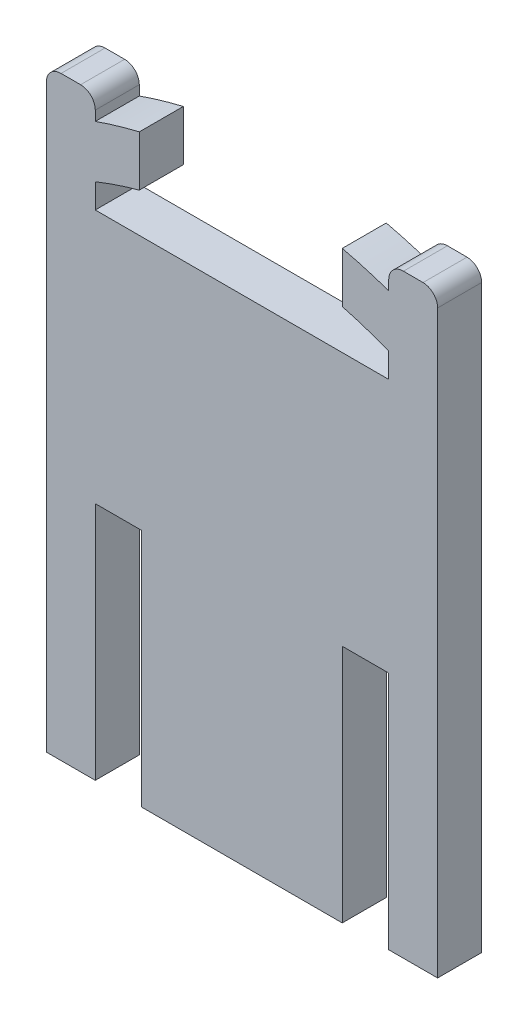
ISO-10303-21;
HEADER;
FILE_DESCRIPTION(('STEP AP214'),'2;1');
FILE_NAME('part.step','',(''),(''),'','','');
FILE_SCHEMA(('AUTOMOTIVE_DESIGN { 1 0 10303 214 1 1 1 1 }'));
ENDSEC;
DATA;
#1=APPLICATION_CONTEXT('core data for automotive mechanical design processes');
#2=APPLICATION_PROTOCOL_DEFINITION('international standard','automotive_design',2000,#1);
#3=PRODUCT_CONTEXT('',#1,'mechanical');
#4=PRODUCT('Part','Part','',(#3));
#5=PRODUCT_RELATED_PRODUCT_CATEGORY('part','',(#4));
#6=PRODUCT_DEFINITION_FORMATION('','',#4);
#7=PRODUCT_DEFINITION_CONTEXT('part definition',#1,'design');
#8=PRODUCT_DEFINITION('design','',#6,#7);
#9=PRODUCT_DEFINITION_SHAPE('','',#8);
#10=(LENGTH_UNIT() NAMED_UNIT(*) SI_UNIT(.MILLI.,.METRE.));
#11=(NAMED_UNIT(*) PLANE_ANGLE_UNIT() SI_UNIT($,.RADIAN.));
#12=(NAMED_UNIT(*) SI_UNIT($,.STERADIAN.) SOLID_ANGLE_UNIT());
#13=UNCERTAINTY_MEASURE_WITH_UNIT(LENGTH_MEASURE(1.E-05),#10,'distance_accuracy_value','');
#14=(GEOMETRIC_REPRESENTATION_CONTEXT(3) GLOBAL_UNCERTAINTY_ASSIGNED_CONTEXT((#13)) GLOBAL_UNIT_ASSIGNED_CONTEXT((#10,
#11,#12)) REPRESENTATION_CONTEXT('',''));
#15=CARTESIAN_POINT('',(0.,0.,0.));
#16=DIRECTION('',(0.,0.,1.));
#17=DIRECTION('',(1.,0.,0.));
#18=AXIS2_PLACEMENT_3D('',#15,#16,#17);
#19=CARTESIAN_POINT('',(-37.,127.683222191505,9.));
#20=DIRECTION('',(0.,0.,-1.));
#21=DIRECTION('',(-1.,0.,0.));
#22=AXIS2_PLACEMENT_3D('',#19,#20,#21);
#23=CYLINDRICAL_SURFACE('',#22,3.);
#24=CARTESIAN_POINT('',(-37.,127.683222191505,0.));
#25=DIRECTION('',(0.,0.,1.));
#26=DIRECTION('',(1.,0.,0.));
#27=AXIS2_PLACEMENT_3D('',#24,#25,#26);
#28=CIRCLE('',#27,3.);
#29=CARTESIAN_POINT('',(-40.,127.683222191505,0.));
#30=VERTEX_POINT('',#29);
#31=CARTESIAN_POINT('',(-37.,130.683222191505,0.));
#32=VERTEX_POINT('',#31);
#33=EDGE_CURVE('E247',#30,#32,#28,.F.);
#34=ORIENTED_EDGE('',*,*,#33,.F.);
#35=DIRECTION('',(0.,0.,-1.));
#36=VECTOR('',#35,1.);
#37=CARTESIAN_POINT('',(-40.,127.683222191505,9.));
#38=LINE('',#37,#36);
#39=CARTESIAN_POINT('',(-40.,127.683222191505,9.));
#40=VERTEX_POINT('',#39);
#41=EDGE_CURVE('E11',#40,#30,#38,.T.);
#42=ORIENTED_EDGE('',*,*,#41,.F.);
#43=CARTESIAN_POINT('',(-37.,127.683222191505,9.));
#44=DIRECTION('',(0.,0.,1.));
#45=DIRECTION('',(1.,0.,0.));
#46=AXIS2_PLACEMENT_3D('',#43,#44,#45);
#47=CIRCLE('',#46,3.);
#48=CARTESIAN_POINT('',(-37.,130.683222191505,9.));
#49=VERTEX_POINT('',#48);
#50=EDGE_CURVE('E321',#40,#49,#47,.F.);
#51=ORIENTED_EDGE('',*,*,#50,.T.);
#52=DIRECTION('',(0.,0.,-1.));
#53=VECTOR('',#52,1.);
#54=CARTESIAN_POINT('',(-37.,130.683222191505,9.));
#55=LINE('',#54,#53);
#56=EDGE_CURVE('E51',#49,#32,#55,.T.);
#57=ORIENTED_EDGE('',*,*,#56,.T.);
#58=EDGE_LOOP('',(#34,#42,#51,#57));
#59=FACE_BOUND('',#58,.T.);
#60=ADVANCED_FACE('F35',(#59),#23,.T.);
#61=CARTESIAN_POINT('',(-40.,-43.5699209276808,9.));
#62=DIRECTION('',(-1.,0.,0.));
#63=DIRECTION('',(0.,0.,1.));
#64=AXIS2_PLACEMENT_3D('',#61,#62,#63);
#65=PLANE('',#64);
#66=DIRECTION('',(0.,1.,0.));
#67=VECTOR('',#66,1.);
#68=CARTESIAN_POINT('',(-40.,-43.5699209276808,0.));
#69=LINE('',#68,#67);
#70=CARTESIAN_POINT('',(-40.,8.99999999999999,0.));
#71=VERTEX_POINT('',#70);
#72=EDGE_CURVE('E249',#71,#30,#69,.T.);
#73=ORIENTED_EDGE('',*,*,#72,.F.);
#74=DIRECTION('',(0.,0.,-1.));
#75=VECTOR('',#74,1.);
#76=CARTESIAN_POINT('',(-40.,8.99999999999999,9.));
#77=LINE('',#76,#75);
#78=CARTESIAN_POINT('',(-40.,8.99999999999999,9.));
#79=VERTEX_POINT('',#78);
#80=EDGE_CURVE('E43',#79,#71,#77,.T.);
#81=ORIENTED_EDGE('',*,*,#80,.F.);
#82=DIRECTION('',(0.,1.,0.));
#83=VECTOR('',#82,1.);
#84=CARTESIAN_POINT('',(-40.,-43.5699209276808,9.));
#85=LINE('',#84,#83);
#86=EDGE_CURVE('E778',#79,#40,#85,.T.);
#87=ORIENTED_EDGE('',*,*,#86,.T.);
#88=ORIENTED_EDGE('',*,*,#41,.T.);
#89=EDGE_LOOP('',(#73,#81,#87,#88));
#90=FACE_BOUND('',#89,.T.);
#91=ADVANCED_FACE('F384',(#90),#65,.T.);
#92=CARTESIAN_POINT('',(0.,8.99999999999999,9.));
#93=DIRECTION('',(0.,-1.,0.));
#94=DIRECTION('',(0.,0.,-1.));
#95=AXIS2_PLACEMENT_3D('',#92,#93,#94);
#96=PLANE('',#95);
#97=DIRECTION('',(-1.,0.,0.));
#98=VECTOR('',#97,1.);
#99=CARTESIAN_POINT('',(0.,8.99999999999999,0.));
#100=LINE('',#99,#98);
#101=CARTESIAN_POINT('',(-30.,9.,0.));
#102=VERTEX_POINT('',#101);
#103=EDGE_CURVE('E252',#102,#71,#100,.T.);
#104=ORIENTED_EDGE('',*,*,#103,.F.);
#105=DIRECTION('',(0.,0.,-1.));
#106=VECTOR('',#105,1.);
#107=CARTESIAN_POINT('',(-30.,9.,9.));
#108=LINE('',#107,#106);
#109=CARTESIAN_POINT('',(-30.,9.,9.));
#110=VERTEX_POINT('',#109);
#111=EDGE_CURVE('E373',#110,#102,#108,.T.);
#112=ORIENTED_EDGE('',*,*,#111,.F.);
#113=DIRECTION('',(-1.,0.,0.));
#114=VECTOR('',#113,1.);
#115=CARTESIAN_POINT('',(0.,8.99999999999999,9.));
#116=LINE('',#115,#114);
#117=EDGE_CURVE('E380',#110,#79,#116,.T.);
#118=ORIENTED_EDGE('',*,*,#117,.T.);
#119=ORIENTED_EDGE('',*,*,#80,.T.);
#120=EDGE_LOOP('',(#104,#112,#118,#119));
#121=FACE_BOUND('',#120,.T.);
#122=ADVANCED_FACE('F378',(#121),#96,.T.);
#123=CARTESIAN_POINT('',(-30.,-43.5699209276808,9.));
#124=DIRECTION('',(-1.,0.,0.));
#125=DIRECTION('',(0.,-1.,0.));
#126=AXIS2_PLACEMENT_3D('',#123,#124,#125);
#127=PLANE('',#126);
#128=DIRECTION('',(0.,1.,0.));
#129=VECTOR('',#128,1.);
#130=CARTESIAN_POINT('',(-30.,-43.5699209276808,0.));
#131=LINE('',#130,#129);
#132=CARTESIAN_POINT('',(-30.,58.,0.));
#133=VERTEX_POINT('',#132);
#134=EDGE_CURVE('E255',#102,#133,#131,.T.);
#135=ORIENTED_EDGE('',*,*,#134,.T.);
#136=DIRECTION('',(0.,0.,-1.));
#137=VECTOR('',#136,1.);
#138=CARTESIAN_POINT('',(-30.,58.,9.));
#139=LINE('',#138,#137);
#140=CARTESIAN_POINT('',(-30.,58.,9.));
#141=VERTEX_POINT('',#140);
#142=EDGE_CURVE('E370',#141,#133,#139,.T.);
#143=ORIENTED_EDGE('',*,*,#142,.F.);
#144=DIRECTION('',(0.,1.,0.));
#145=VECTOR('',#144,1.);
#146=CARTESIAN_POINT('',(-30.,-43.5699209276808,9.));
#147=LINE('',#146,#145);
#148=EDGE_CURVE('E401',#110,#141,#147,.T.);
#149=ORIENTED_EDGE('',*,*,#148,.F.);
#150=ORIENTED_EDGE('',*,*,#111,.T.);
#151=EDGE_LOOP('',(#135,#143,#149,#150));
#152=FACE_BOUND('',#151,.T.);
#153=ADVANCED_FACE('F392',(#152),#127,.F.);
#154=CARTESIAN_POINT('',(0.,58.,9.));
#155=DIRECTION('',(0.,1.,0.));
#156=DIRECTION('',(0.,0.,1.));
#157=AXIS2_PLACEMENT_3D('',#154,#155,#156);
#158=PLANE('',#157);
#159=DIRECTION('',(1.,0.,0.));
#160=VECTOR('',#159,1.);
#161=CARTESIAN_POINT('',(0.,58.,0.));
#162=LINE('',#161,#160);
#163=CARTESIAN_POINT('',(-20.5,58.,0.));
#164=VERTEX_POINT('',#163);
#165=EDGE_CURVE('E257',#133,#164,#162,.T.);
#166=ORIENTED_EDGE('',*,*,#165,.T.);
#167=DIRECTION('',(0.,0.,-1.));
#168=VECTOR('',#167,1.);
#169=CARTESIAN_POINT('',(-20.5,58.,9.));
#170=LINE('',#169,#168);
#171=CARTESIAN_POINT('',(-20.5,58.,9.));
#172=VERTEX_POINT('',#171);
#173=EDGE_CURVE('E367',#172,#164,#170,.T.);
#174=ORIENTED_EDGE('',*,*,#173,.F.);
#175=DIRECTION('',(1.,0.,0.));
#176=VECTOR('',#175,1.);
#177=CARTESIAN_POINT('',(0.,58.,9.));
#178=LINE('',#177,#176);
#179=EDGE_CURVE('E398',#141,#172,#178,.T.);
#180=ORIENTED_EDGE('',*,*,#179,.F.);
#181=ORIENTED_EDGE('',*,*,#142,.T.);
#182=EDGE_LOOP('',(#166,#174,#180,#181));
#183=FACE_BOUND('',#182,.T.);
#184=ADVANCED_FACE('F396',(#183),#158,.F.);
#185=CARTESIAN_POINT('',(-20.5,-43.5699209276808,9.));
#186=DIRECTION('',(1.,0.,0.));
#187=DIRECTION('',(0.,1.,0.));
#188=AXIS2_PLACEMENT_3D('',#185,#186,#187);
#189=PLANE('',#188);
#190=DIRECTION('',(0.,-1.,0.));
#191=VECTOR('',#190,1.);
#192=CARTESIAN_POINT('',(-20.5,-43.5699209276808,0.));
#193=LINE('',#192,#191);
#194=CARTESIAN_POINT('',(-20.5,8.99999999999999,0.));
#195=VERTEX_POINT('',#194);
#196=EDGE_CURVE('E259',#164,#195,#193,.T.);
#197=ORIENTED_EDGE('',*,*,#196,.T.);
#198=DIRECTION('',(0.,0.,-1.));
#199=VECTOR('',#198,1.);
#200=CARTESIAN_POINT('',(-20.5,8.99999999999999,9.));
#201=LINE('',#200,#199);
#202=CARTESIAN_POINT('',(-20.5,8.99999999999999,9.));
#203=VERTEX_POINT('',#202);
#204=EDGE_CURVE('E365',#203,#195,#201,.T.);
#205=ORIENTED_EDGE('',*,*,#204,.F.);
#206=DIRECTION('',(0.,-1.,0.));
#207=VECTOR('',#206,1.);
#208=CARTESIAN_POINT('',(-20.5,-43.5699209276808,9.));
#209=LINE('',#208,#207);
#210=EDGE_CURVE('E400',#172,#203,#209,.T.);
#211=ORIENTED_EDGE('',*,*,#210,.F.);
#212=ORIENTED_EDGE('',*,*,#173,.T.);
#213=EDGE_LOOP('',(#197,#205,#211,#212));
#214=FACE_BOUND('',#213,.T.);
#215=ADVANCED_FACE('F485',(#214),#189,.F.);
#216=CARTESIAN_POINT('',(0.,9.,9.));
#217=DIRECTION('',(0.,-1.,0.));
#218=DIRECTION('',(1.,0.,0.));
#219=AXIS2_PLACEMENT_3D('',#216,#217,#218);
#220=PLANE('',#219);
#221=DIRECTION('',(-1.,0.,0.));
#222=VECTOR('',#221,1.);
#223=CARTESIAN_POINT('',(0.,9.,0.));
#224=LINE('',#223,#222);
#225=CARTESIAN_POINT('',(20.5,9.,0.));
#226=VERTEX_POINT('',#225);
#227=EDGE_CURVE('E262',#226,#195,#224,.T.);
#228=ORIENTED_EDGE('',*,*,#227,.F.);
#229=DIRECTION('',(0.,0.,-1.));
#230=VECTOR('',#229,1.);
#231=CARTESIAN_POINT('',(20.5,9.,9.));
#232=LINE('',#231,#230);
#233=CARTESIAN_POINT('',(20.5,9.,9.));
#234=VERTEX_POINT('',#233);
#235=EDGE_CURVE('E363',#234,#226,#232,.T.);
#236=ORIENTED_EDGE('',*,*,#235,.F.);
#237=DIRECTION('',(-1.,0.,0.));
#238=VECTOR('',#237,1.);
#239=CARTESIAN_POINT('',(0.,9.,9.));
#240=LINE('',#239,#238);
#241=EDGE_CURVE('E403',#234,#203,#240,.T.);
#242=ORIENTED_EDGE('',*,*,#241,.T.);
#243=ORIENTED_EDGE('',*,*,#204,.T.);
#244=EDGE_LOOP('',(#228,#236,#242,#243));
#245=FACE_BOUND('',#244,.T.);
#246=ADVANCED_FACE('F488',(#245),#220,.T.);
#247=CARTESIAN_POINT('',(20.5,-43.5699209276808,9.));
#248=DIRECTION('',(1.,0.,0.));
#249=DIRECTION('',(0.,1.,0.));
#250=AXIS2_PLACEMENT_3D('',#247,#248,#249);
#251=PLANE('',#250);
#252=DIRECTION('',(0.,-1.,0.));
#253=VECTOR('',#252,1.);
#254=CARTESIAN_POINT('',(20.5,-43.5699209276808,0.));
#255=LINE('',#254,#253);
#256=CARTESIAN_POINT('',(20.5,58.,0.));
#257=VERTEX_POINT('',#256);
#258=EDGE_CURVE('E265',#257,#226,#255,.T.);
#259=ORIENTED_EDGE('',*,*,#258,.F.);
#260=DIRECTION('',(0.,0.,-1.));
#261=VECTOR('',#260,1.);
#262=CARTESIAN_POINT('',(20.5,58.,9.));
#263=LINE('',#262,#261);
#264=CARTESIAN_POINT('',(20.5,58.,9.));
#265=VERTEX_POINT('',#264);
#266=EDGE_CURVE('E361',#265,#257,#263,.T.);
#267=ORIENTED_EDGE('',*,*,#266,.F.);
#268=DIRECTION('',(0.,-1.,0.));
#269=VECTOR('',#268,1.);
#270=CARTESIAN_POINT('',(20.5,-43.5699209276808,9.));
#271=LINE('',#270,#269);
#272=EDGE_CURVE('E410',#265,#234,#271,.T.);
#273=ORIENTED_EDGE('',*,*,#272,.T.);
#274=ORIENTED_EDGE('',*,*,#235,.T.);
#275=EDGE_LOOP('',(#259,#267,#273,#274));
#276=FACE_BOUND('',#275,.T.);
#277=ADVANCED_FACE('F492',(#276),#251,.T.);
#278=CARTESIAN_POINT('',(0.,58.,9.));
#279=DIRECTION('',(0.,-1.,0.));
#280=DIRECTION('',(1.,0.,0.));
#281=AXIS2_PLACEMENT_3D('',#278,#279,#280);
#282=PLANE('',#281);
#283=DIRECTION('',(-1.,0.,0.));
#284=VECTOR('',#283,1.);
#285=CARTESIAN_POINT('',(0.,58.,0.));
#286=LINE('',#285,#284);
#287=CARTESIAN_POINT('',(30.,58.,0.));
#288=VERTEX_POINT('',#287);
#289=EDGE_CURVE('E268',#288,#257,#286,.T.);
#290=ORIENTED_EDGE('',*,*,#289,.F.);
#291=DIRECTION('',(0.,0.,-1.));
#292=VECTOR('',#291,1.);
#293=CARTESIAN_POINT('',(30.,58.,9.));
#294=LINE('',#293,#292);
#295=CARTESIAN_POINT('',(30.,58.,9.));
#296=VERTEX_POINT('',#295);
#297=EDGE_CURVE('E359',#296,#288,#294,.T.);
#298=ORIENTED_EDGE('',*,*,#297,.F.);
#299=DIRECTION('',(-1.,0.,0.));
#300=VECTOR('',#299,1.);
#301=CARTESIAN_POINT('',(0.,58.,9.));
#302=LINE('',#301,#300);
#303=EDGE_CURVE('E413',#296,#265,#302,.T.);
#304=ORIENTED_EDGE('',*,*,#303,.T.);
#305=ORIENTED_EDGE('',*,*,#266,.T.);
#306=EDGE_LOOP('',(#290,#298,#304,#305));
#307=FACE_BOUND('',#306,.T.);
#308=ADVANCED_FACE('F496',(#307),#282,.T.);
#309=CARTESIAN_POINT('',(30.,-43.5699209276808,9.));
#310=DIRECTION('',(-1.,0.,0.));
#311=DIRECTION('',(0.,-1.,0.));
#312=AXIS2_PLACEMENT_3D('',#309,#310,#311);
#313=PLANE('',#312);
#314=DIRECTION('',(0.,1.,0.));
#315=VECTOR('',#314,1.);
#316=CARTESIAN_POINT('',(30.,-43.5699209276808,0.));
#317=LINE('',#316,#315);
#318=CARTESIAN_POINT('',(30.,9.00000000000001,0.));
#319=VERTEX_POINT('',#318);
#320=EDGE_CURVE('E271',#319,#288,#317,.T.);
#321=ORIENTED_EDGE('',*,*,#320,.F.);
#322=DIRECTION('',(0.,0.,-1.));
#323=VECTOR('',#322,1.);
#324=CARTESIAN_POINT('',(30.,9.00000000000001,9.));
#325=LINE('',#324,#323);
#326=CARTESIAN_POINT('',(30.,9.00000000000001,9.));
#327=VERTEX_POINT('',#326);
#328=EDGE_CURVE('E357',#327,#319,#325,.T.);
#329=ORIENTED_EDGE('',*,*,#328,.F.);
#330=DIRECTION('',(0.,1.,0.));
#331=VECTOR('',#330,1.);
#332=CARTESIAN_POINT('',(30.,-43.5699209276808,9.));
#333=LINE('',#332,#331);
#334=EDGE_CURVE('E416',#327,#296,#333,.T.);
#335=ORIENTED_EDGE('',*,*,#334,.T.);
#336=ORIENTED_EDGE('',*,*,#297,.T.);
#337=EDGE_LOOP('',(#321,#329,#335,#336));
#338=FACE_BOUND('',#337,.T.);
#339=ADVANCED_FACE('F500',(#338),#313,.T.);
#340=CARTESIAN_POINT('',(0.,9.00000000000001,9.));
#341=DIRECTION('',(0.,1.,0.));
#342=DIRECTION('',(0.,0.,1.));
#343=AXIS2_PLACEMENT_3D('',#340,#341,#342);
#344=PLANE('',#343);
#345=DIRECTION('',(1.,0.,0.));
#346=VECTOR('',#345,1.);
#347=CARTESIAN_POINT('',(0.,9.00000000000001,0.));
#348=LINE('',#347,#346);
#349=CARTESIAN_POINT('',(40.,9.00000000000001,0.));
#350=VERTEX_POINT('',#349);
#351=EDGE_CURVE('E274',#319,#350,#348,.T.);
#352=ORIENTED_EDGE('',*,*,#351,.T.);
#353=DIRECTION('',(0.,0.,-1.));
#354=VECTOR('',#353,1.);
#355=CARTESIAN_POINT('',(40.,9.00000000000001,9.));
#356=LINE('',#355,#354);
#357=CARTESIAN_POINT('',(40.,9.00000000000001,9.));
#358=VERTEX_POINT('',#357);
#359=EDGE_CURVE('E354',#358,#350,#356,.T.);
#360=ORIENTED_EDGE('',*,*,#359,.F.);
#361=DIRECTION('',(1.,0.,0.));
#362=VECTOR('',#361,1.);
#363=CARTESIAN_POINT('',(0.,9.00000000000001,9.));
#364=LINE('',#363,#362);
#365=EDGE_CURVE('E419',#327,#358,#364,.T.);
#366=ORIENTED_EDGE('',*,*,#365,.F.);
#367=ORIENTED_EDGE('',*,*,#328,.T.);
#368=EDGE_LOOP('',(#352,#360,#366,#367));
#369=FACE_BOUND('',#368,.T.);
#370=ADVANCED_FACE('F504',(#369),#344,.F.);
#371=CARTESIAN_POINT('',(40.,-43.5699209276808,9.));
#372=DIRECTION('',(-1.,0.,0.));
#373=DIRECTION('',(0.,-1.,0.));
#374=AXIS2_PLACEMENT_3D('',#371,#372,#373);
#375=PLANE('',#374);
#376=DIRECTION('',(0.,1.,0.));
#377=VECTOR('',#376,1.);
#378=CARTESIAN_POINT('',(40.,-43.5699209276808,0.));
#379=LINE('',#378,#377);
#380=CARTESIAN_POINT('',(40.,127.654703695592,0.));
#381=VERTEX_POINT('',#380);
#382=EDGE_CURVE('E276',#350,#381,#379,.T.);
#383=ORIENTED_EDGE('',*,*,#382,.T.);
#384=DIRECTION('',(0.,0.,-1.));
#385=VECTOR('',#384,1.);
#386=CARTESIAN_POINT('',(40.,127.654703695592,9.));
#387=LINE('',#386,#385);
#388=CARTESIAN_POINT('',(40.,127.654703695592,9.));
#389=VERTEX_POINT('',#388);
#390=EDGE_CURVE('E352',#389,#381,#387,.T.);
#391=ORIENTED_EDGE('',*,*,#390,.F.);
#392=DIRECTION('',(0.,1.,0.));
#393=VECTOR('',#392,1.);
#394=CARTESIAN_POINT('',(40.,-43.5699209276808,9.));
#395=LINE('',#394,#393);
#396=EDGE_CURVE('E421',#358,#389,#395,.T.);
#397=ORIENTED_EDGE('',*,*,#396,.F.);
#398=ORIENTED_EDGE('',*,*,#359,.T.);
#399=EDGE_LOOP('',(#383,#391,#397,#398));
#400=FACE_BOUND('',#399,.T.);
#401=ADVANCED_FACE('F508',(#400),#375,.F.);
#402=CARTESIAN_POINT('',(37.,127.654703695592,9.));
#403=DIRECTION('',(0.,0.,-1.));
#404=DIRECTION('',(-1.,0.,0.));
#405=AXIS2_PLACEMENT_3D('',#402,#403,#404);
#406=CYLINDRICAL_SURFACE('',#405,3.);
#407=CARTESIAN_POINT('',(37.,127.654703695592,0.));
#408=DIRECTION('',(0.,0.,1.));
#409=DIRECTION('',(1.,0.,0.));
#410=AXIS2_PLACEMENT_3D('',#407,#408,#409);
#411=CIRCLE('',#410,3.);
#412=CARTESIAN_POINT('',(37.0122114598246,130.654678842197,0.));
#413=VERTEX_POINT('',#412);
#414=EDGE_CURVE('E279',#413,#381,#411,.F.);
#415=ORIENTED_EDGE('',*,*,#414,.F.);
#416=DIRECTION('',(0.,0.,-1.));
#417=VECTOR('',#416,1.);
#418=CARTESIAN_POINT('',(37.0122114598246,130.654678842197,9.));
#419=LINE('',#418,#417);
#420=CARTESIAN_POINT('',(37.0122114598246,130.654678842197,9.));
#421=VERTEX_POINT('',#420);
#422=EDGE_CURVE('E350',#421,#413,#419,.T.);
#423=ORIENTED_EDGE('',*,*,#422,.F.);
#424=CARTESIAN_POINT('',(37.,127.654703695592,9.));
#425=DIRECTION('',(0.,0.,1.));
#426=DIRECTION('',(1.,0.,0.));
#427=AXIS2_PLACEMENT_3D('',#424,#425,#426);
#428=CIRCLE('',#427,3.);
#429=EDGE_CURVE('E423',#421,#389,#428,.F.);
#430=ORIENTED_EDGE('',*,*,#429,.T.);
#431=ORIENTED_EDGE('',*,*,#390,.T.);
#432=EDGE_LOOP('',(#415,#423,#430,#431));
#433=FACE_BOUND('',#432,.T.);
#434=ADVANCED_FACE('F512',(#433),#406,.T.);
#435=CARTESIAN_POINT('',(0.70978627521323,130.80244860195,9.));
#436=DIRECTION('',(-0.00407048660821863,-0.99999171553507,0.));
#437=DIRECTION('',(0.99999171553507,-0.00407048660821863,0.));
#438=AXIS2_PLACEMENT_3D('',#435,#436,#437);
#439=PLANE('',#438);
#440=DIRECTION('',(-0.99999171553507,0.00407048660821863,0.));
#441=VECTOR('',#440,1.);
#442=CARTESIAN_POINT('',(0.70978627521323,130.80244860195,0.));
#443=LINE('',#442,#441);
#444=CARTESIAN_POINT('',(33.0122114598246,130.670960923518,0.));
#445=VERTEX_POINT('',#444);
#446=EDGE_CURVE('E282',#413,#445,#443,.T.);
#447=ORIENTED_EDGE('',*,*,#446,.T.);
#448=DIRECTION('',(0.,0.,-1.));
#449=VECTOR('',#448,1.);
#450=CARTESIAN_POINT('',(33.0122114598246,130.670960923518,9.));
#451=LINE('',#450,#449);
#452=CARTESIAN_POINT('',(33.0122114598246,130.670960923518,9.));
#453=VERTEX_POINT('',#452);
#454=EDGE_CURVE('E348',#453,#445,#451,.T.);
#455=ORIENTED_EDGE('',*,*,#454,.F.);
#456=DIRECTION('',(-0.99999171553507,0.00407048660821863,0.));
#457=VECTOR('',#456,1.);
#458=CARTESIAN_POINT('',(0.70978627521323,130.80244860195,9.));
#459=LINE('',#458,#457);
#460=EDGE_CURVE('E426',#421,#453,#459,.T.);
#461=ORIENTED_EDGE('',*,*,#460,.F.);
#462=ORIENTED_EDGE('',*,*,#422,.T.);
#463=EDGE_LOOP('',(#447,#455,#461,#462));
#464=FACE_BOUND('',#463,.T.);
#465=ADVANCED_FACE('F516',(#464),#439,.F.);
#466=CARTESIAN_POINT('',(33.,127.670985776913,9.));
#467=DIRECTION('',(0.,0.,-1.));
#468=DIRECTION('',(-1.,0.,0.));
#469=AXIS2_PLACEMENT_3D('',#466,#467,#468);
#470=CYLINDRICAL_SURFACE('',#469,3.00000000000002);
#471=CARTESIAN_POINT('',(33.,127.670985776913,0.));
#472=DIRECTION('',(0.,0.,1.));
#473=DIRECTION('',(1.,0.,0.));
#474=AXIS2_PLACEMENT_3D('',#471,#472,#473);
#475=CIRCLE('',#474,3.00000000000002);
#476=CARTESIAN_POINT('',(30.,127.670985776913,0.));
#477=VERTEX_POINT('',#476);
#478=EDGE_CURVE('E285',#477,#445,#475,.F.);
#479=ORIENTED_EDGE('',*,*,#478,.F.);
#480=DIRECTION('',(0.,0.,-1.));
#481=VECTOR('',#480,1.);
#482=CARTESIAN_POINT('',(30.,127.670985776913,9.));
#483=LINE('',#482,#481);
#484=CARTESIAN_POINT('',(30.,127.670985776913,9.));
#485=VERTEX_POINT('',#484);
#486=EDGE_CURVE('E346',#485,#477,#483,.T.);
#487=ORIENTED_EDGE('',*,*,#486,.F.);
#488=CARTESIAN_POINT('',(33.,127.670985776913,9.));
#489=DIRECTION('',(0.,0.,1.));
#490=DIRECTION('',(1.,0.,0.));
#491=AXIS2_PLACEMENT_3D('',#488,#489,#490);
#492=CIRCLE('',#491,3.00000000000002);
#493=EDGE_CURVE('E428',#485,#453,#492,.F.);
#494=ORIENTED_EDGE('',*,*,#493,.T.);
#495=ORIENTED_EDGE('',*,*,#454,.T.);
#496=EDGE_LOOP('',(#479,#487,#494,#495));
#497=FACE_BOUND('',#496,.T.);
#498=ADVANCED_FACE('F520',(#497),#470,.T.);
#499=CARTESIAN_POINT('',(30.0000000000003,-43.5699209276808,9.));
#500=DIRECTION('',(1.,0.,0.));
#501=DIRECTION('',(0.,1.,0.));
#502=AXIS2_PLACEMENT_3D('',#499,#500,#501);
#503=PLANE('',#502);
#504=DIRECTION('',(0.,-1.,0.));
#505=VECTOR('',#504,1.);
#506=CARTESIAN_POINT('',(30.0000000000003,-43.5699209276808,0.));
#507=LINE('',#506,#505);
#508=CARTESIAN_POINT('',(30.,125.683180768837,0.));
#509=VERTEX_POINT('',#508);
#510=EDGE_CURVE('E288',#477,#509,#507,.T.);
#511=ORIENTED_EDGE('',*,*,#510,.T.);
#512=DIRECTION('',(0.,0.,-1.));
#513=VECTOR('',#512,1.);
#514=CARTESIAN_POINT('',(30.,125.683180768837,9.));
#515=LINE('',#514,#513);
#516=CARTESIAN_POINT('',(30.,125.683180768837,9.));
#517=VERTEX_POINT('',#516);
#518=EDGE_CURVE('E343',#517,#509,#515,.T.);
#519=ORIENTED_EDGE('',*,*,#518,.F.);
#520=DIRECTION('',(0.,-1.,0.));
#521=VECTOR('',#520,1.);
#522=CARTESIAN_POINT('',(30.0000000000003,-43.5699209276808,9.));
#523=LINE('',#522,#521);
#524=EDGE_CURVE('E431',#485,#517,#523,.T.);
#525=ORIENTED_EDGE('',*,*,#524,.F.);
#526=ORIENTED_EDGE('',*,*,#486,.T.);
#527=EDGE_LOOP('',(#511,#519,#525,#526));
#528=FACE_BOUND('',#527,.T.);
#529=ADVANCED_FACE('F524',(#528),#503,.F.);
#530=CARTESIAN_POINT('',(0.,40.3774210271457,9.));
#531=DIRECTION('',(0.,0.,-1.));
#532=DIRECTION('',(-1.,0.,0.));
#533=AXIS2_PLACEMENT_3D('',#530,#531,#532);
#534=CYLINDRICAL_SURFACE('',#533,90.4271676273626);
#535=CARTESIAN_POINT('',(0.,40.3774210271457,0.));
#536=DIRECTION('',(0.,0.,1.));
#537=DIRECTION('',(1.,0.,0.));
#538=AXIS2_PLACEMENT_3D('',#535,#536,#537);
#539=CIRCLE('',#538,90.4271676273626);
#540=CARTESIAN_POINT('',(20.5,128.450246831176,0.));
#541=VERTEX_POINT('',#540);
#542=EDGE_CURVE('E290',#509,#541,#539,.T.);
#543=ORIENTED_EDGE('',*,*,#542,.T.);
#544=DIRECTION('',(0.,0.,-1.));
#545=VECTOR('',#544,1.);
#546=CARTESIAN_POINT('',(20.5,128.450246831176,9.));
#547=LINE('',#546,#545);
#548=CARTESIAN_POINT('',(20.5,128.450246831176,9.));
#549=VERTEX_POINT('',#548);
#550=EDGE_CURVE('E340',#549,#541,#547,.T.);
#551=ORIENTED_EDGE('',*,*,#550,.F.);
#552=CARTESIAN_POINT('',(0.,40.3774210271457,9.));
#553=DIRECTION('',(0.,0.,1.));
#554=DIRECTION('',(1.,0.,0.));
#555=AXIS2_PLACEMENT_3D('',#552,#553,#554);
#556=CIRCLE('',#555,90.4271676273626);
#557=EDGE_CURVE('E433',#517,#549,#556,.T.);
#558=ORIENTED_EDGE('',*,*,#557,.F.);
#559=ORIENTED_EDGE('',*,*,#518,.T.);
#560=EDGE_LOOP('',(#543,#551,#558,#559));
#561=FACE_BOUND('',#560,.T.);
#562=ADVANCED_FACE('F528',(#561),#534,.T.);
#563=CARTESIAN_POINT('',(20.5,-43.5699209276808,9.));
#564=DIRECTION('',(1.,0.,0.));
#565=DIRECTION('',(0.,0.,-1.));
#566=AXIS2_PLACEMENT_3D('',#563,#564,#565);
#567=PLANE('',#566);
#568=DIRECTION('',(0.,-1.,0.));
#569=VECTOR('',#568,1.);
#570=CARTESIAN_POINT('',(20.5,-43.5699209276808,0.));
#571=LINE('',#570,#569);
#572=CARTESIAN_POINT('',(20.5,118.14810504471,0.));
#573=VERTEX_POINT('',#572);
#574=EDGE_CURVE('E292',#541,#573,#571,.T.);
#575=ORIENTED_EDGE('',*,*,#574,.T.);
#576=DIRECTION('',(0.,0.,-1.));
#577=VECTOR('',#576,1.);
#578=CARTESIAN_POINT('',(20.5,118.14810504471,9.));
#579=LINE('',#578,#577);
#580=CARTESIAN_POINT('',(20.5,118.14810504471,9.));
#581=VERTEX_POINT('',#580);
#582=EDGE_CURVE('E338',#581,#573,#579,.T.);
#583=ORIENTED_EDGE('',*,*,#582,.F.);
#584=DIRECTION('',(0.,-1.,0.));
#585=VECTOR('',#584,1.);
#586=CARTESIAN_POINT('',(20.5,-43.5699209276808,9.));
#587=LINE('',#586,#585);
#588=EDGE_CURVE('E435',#549,#581,#587,.T.);
#589=ORIENTED_EDGE('',*,*,#588,.F.);
#590=ORIENTED_EDGE('',*,*,#550,.T.);
#591=EDGE_LOOP('',(#575,#583,#589,#590));
#592=FACE_BOUND('',#591,.T.);
#593=ADVANCED_FACE('F532',(#592),#567,.F.);
#594=CARTESIAN_POINT('',(0.,40.3774210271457,9.));
#595=DIRECTION('',(0.,0.,-1.));
#596=DIRECTION('',(-1.,0.,0.));
#597=AXIS2_PLACEMENT_3D('',#594,#595,#596);
#598=CYLINDRICAL_SURFACE('',#597,80.4271676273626);
#599=CARTESIAN_POINT('',(0.,40.3774210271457,0.));
#600=DIRECTION('',(0.,0.,1.));
#601=DIRECTION('',(1.,0.,0.));
#602=AXIS2_PLACEMENT_3D('',#599,#600,#601);
#603=CIRCLE('',#602,80.4271676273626);
#604=CARTESIAN_POINT('',(30.,115.,0.));
#605=VERTEX_POINT('',#604);
#606=EDGE_CURVE('E295',#605,#573,#603,.T.);
#607=ORIENTED_EDGE('',*,*,#606,.F.);
#608=DIRECTION('',(0.,0.,-1.));
#609=VECTOR('',#608,1.);
#610=CARTESIAN_POINT('',(30.,115.,9.));
#611=LINE('',#610,#609);
#612=CARTESIAN_POINT('',(30.,115.,9.));
#613=VERTEX_POINT('',#612);
#614=EDGE_CURVE('E336',#613,#605,#611,.T.);
#615=ORIENTED_EDGE('',*,*,#614,.F.);
#616=CARTESIAN_POINT('',(0.,40.3774210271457,9.));
#617=DIRECTION('',(0.,0.,1.));
#618=DIRECTION('',(1.,0.,0.));
#619=AXIS2_PLACEMENT_3D('',#616,#617,#618);
#620=CIRCLE('',#619,80.4271676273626);
#621=EDGE_CURVE('E437',#613,#581,#620,.T.);
#622=ORIENTED_EDGE('',*,*,#621,.T.);
#623=ORIENTED_EDGE('',*,*,#582,.T.);
#624=EDGE_LOOP('',(#607,#615,#622,#623));
#625=FACE_BOUND('',#624,.T.);
#626=ADVANCED_FACE('F536',(#625),#598,.F.);
#627=CARTESIAN_POINT('',(29.9999999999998,-43.5699209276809,9.));
#628=DIRECTION('',(1.,0.,0.));
#629=DIRECTION('',(0.,1.,0.));
#630=AXIS2_PLACEMENT_3D('',#627,#628,#629);
#631=PLANE('',#630);
#632=DIRECTION('',(0.,-1.,0.));
#633=VECTOR('',#632,1.);
#634=CARTESIAN_POINT('',(29.9999999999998,-43.5699209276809,0.));
#635=LINE('',#634,#633);
#636=CARTESIAN_POINT('',(30.,110.,0.));
#637=VERTEX_POINT('',#636);
#638=EDGE_CURVE('E298',#605,#637,#635,.T.);
#639=ORIENTED_EDGE('',*,*,#638,.T.);
#640=DIRECTION('',(0.,0.,-1.));
#641=VECTOR('',#640,1.);
#642=CARTESIAN_POINT('',(30.,110.,9.));
#643=LINE('',#642,#641);
#644=CARTESIAN_POINT('',(30.,110.,9.));
#645=VERTEX_POINT('',#644);
#646=EDGE_CURVE('E334',#645,#637,#643,.T.);
#647=ORIENTED_EDGE('',*,*,#646,.F.);
#648=DIRECTION('',(0.,-1.,0.));
#649=VECTOR('',#648,1.);
#650=CARTESIAN_POINT('',(29.9999999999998,-43.5699209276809,9.));
#651=LINE('',#650,#649);
#652=EDGE_CURVE('E440',#613,#645,#651,.T.);
#653=ORIENTED_EDGE('',*,*,#652,.F.);
#654=ORIENTED_EDGE('',*,*,#614,.T.);
#655=EDGE_LOOP('',(#639,#647,#653,#654));
#656=FACE_BOUND('',#655,.T.);
#657=ADVANCED_FACE('F540',(#656),#631,.F.);
#658=CARTESIAN_POINT('',(0.,110.,9.));
#659=DIRECTION('',(0.,1.,0.));
#660=DIRECTION('',(0.,0.,1.));
#661=AXIS2_PLACEMENT_3D('',#658,#659,#660);
#662=PLANE('',#661);
#663=DIRECTION('',(1.,0.,0.));
#664=VECTOR('',#663,1.);
#665=CARTESIAN_POINT('',(0.,110.,0.));
#666=LINE('',#665,#664);
#667=CARTESIAN_POINT('',(-30.,110.,0.));
#668=VERTEX_POINT('',#667);
#669=EDGE_CURVE('E301',#668,#637,#666,.T.);
#670=ORIENTED_EDGE('',*,*,#669,.F.);
#671=DIRECTION('',(0.,0.,-1.));
#672=VECTOR('',#671,1.);
#673=CARTESIAN_POINT('',(-30.,110.,9.));
#674=LINE('',#673,#672);
#675=CARTESIAN_POINT('',(-30.,110.,9.));
#676=VERTEX_POINT('',#675);
#677=EDGE_CURVE('E332',#676,#668,#674,.T.);
#678=ORIENTED_EDGE('',*,*,#677,.F.);
#679=DIRECTION('',(1.,0.,0.));
#680=VECTOR('',#679,1.);
#681=CARTESIAN_POINT('',(0.,110.,9.));
#682=LINE('',#681,#680);
#683=EDGE_CURVE('E442',#676,#645,#682,.T.);
#684=ORIENTED_EDGE('',*,*,#683,.T.);
#685=ORIENTED_EDGE('',*,*,#646,.T.);
#686=EDGE_LOOP('',(#670,#678,#684,#685));
#687=FACE_BOUND('',#686,.T.);
#688=ADVANCED_FACE('F544',(#687),#662,.T.);
#689=CARTESIAN_POINT('',(-29.9999999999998,-43.5699209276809,9.));
#690=DIRECTION('',(1.,0.,0.));
#691=DIRECTION('',(0.,1.,0.));
#692=AXIS2_PLACEMENT_3D('',#689,#690,#691);
#693=PLANE('',#692);
#694=DIRECTION('',(0.,-1.,0.));
#695=VECTOR('',#694,1.);
#696=CARTESIAN_POINT('',(-29.9999999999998,-43.5699209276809,0.));
#697=LINE('',#696,#695);
#698=CARTESIAN_POINT('',(-30.,115.,0.));
#699=VERTEX_POINT('',#698);
#700=EDGE_CURVE('E304',#699,#668,#697,.T.);
#701=ORIENTED_EDGE('',*,*,#700,.F.);
#702=DIRECTION('',(0.,0.,-1.));
#703=VECTOR('',#702,1.);
#704=CARTESIAN_POINT('',(-30.,115.,9.));
#705=LINE('',#704,#703);
#706=CARTESIAN_POINT('',(-30.,115.,9.));
#707=VERTEX_POINT('',#706);
#708=EDGE_CURVE('E330',#707,#699,#705,.T.);
#709=ORIENTED_EDGE('',*,*,#708,.F.);
#710=DIRECTION('',(0.,-1.,0.));
#711=VECTOR('',#710,1.);
#712=CARTESIAN_POINT('',(-29.9999999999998,-43.5699209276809,9.));
#713=LINE('',#712,#711);
#714=EDGE_CURVE('E445',#707,#676,#713,.T.);
#715=ORIENTED_EDGE('',*,*,#714,.T.);
#716=ORIENTED_EDGE('',*,*,#677,.T.);
#717=EDGE_LOOP('',(#701,#709,#715,#716));
#718=FACE_BOUND('',#717,.T.);
#719=ADVANCED_FACE('F548',(#718),#693,.T.);
#720=CARTESIAN_POINT('',(0.,40.3774210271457,9.));
#721=DIRECTION('',(0.,0.,-1.));
#722=DIRECTION('',(-1.,0.,0.));
#723=AXIS2_PLACEMENT_3D('',#720,#721,#722);
#724=CYLINDRICAL_SURFACE('',#723,80.4271676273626);
#725=CARTESIAN_POINT('',(0.,40.3774210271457,0.));
#726=DIRECTION('',(0.,0.,1.));
#727=DIRECTION('',(1.,0.,0.));
#728=AXIS2_PLACEMENT_3D('',#725,#726,#727);
#729=CIRCLE('',#728,80.4271676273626);
#730=CARTESIAN_POINT('',(-21.,118.014585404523,0.));
#731=VERTEX_POINT('',#730);
#732=EDGE_CURVE('E307',#731,#699,#729,.T.);
#733=ORIENTED_EDGE('',*,*,#732,.F.);
#734=DIRECTION('',(0.,0.,-1.));
#735=VECTOR('',#734,1.);
#736=CARTESIAN_POINT('',(-21.,118.014585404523,9.));
#737=LINE('',#736,#735);
#738=CARTESIAN_POINT('',(-21.,118.014585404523,9.));
#739=VERTEX_POINT('',#738);
#740=EDGE_CURVE('E328',#739,#731,#737,.T.);
#741=ORIENTED_EDGE('',*,*,#740,.F.);
#742=CARTESIAN_POINT('',(0.,40.3774210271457,9.));
#743=DIRECTION('',(0.,0.,1.));
#744=DIRECTION('',(1.,0.,0.));
#745=AXIS2_PLACEMENT_3D('',#742,#743,#744);
#746=CIRCLE('',#745,80.4271676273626);
#747=EDGE_CURVE('E448',#739,#707,#746,.T.);
#748=ORIENTED_EDGE('',*,*,#747,.T.);
#749=ORIENTED_EDGE('',*,*,#708,.T.);
#750=EDGE_LOOP('',(#733,#741,#748,#749));
#751=FACE_BOUND('',#750,.T.);
#752=ADVANCED_FACE('F552',(#751),#724,.F.);
#753=CARTESIAN_POINT('',(-21.,-43.5699209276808,9.));
#754=DIRECTION('',(-1.,0.,0.));
#755=DIRECTION('',(0.,0.,1.));
#756=AXIS2_PLACEMENT_3D('',#753,#754,#755);
#757=PLANE('',#756);
#758=DIRECTION('',(0.,1.,0.));
#759=VECTOR('',#758,1.);
#760=CARTESIAN_POINT('',(-21.,-43.5699209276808,0.));
#761=LINE('',#760,#759);
#762=CARTESIAN_POINT('',(-21.,128.332367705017,0.));
#763=VERTEX_POINT('',#762);
#764=EDGE_CURVE('E310',#731,#763,#761,.T.);
#765=ORIENTED_EDGE('',*,*,#764,.T.);
#766=DIRECTION('',(0.,0.,-1.));
#767=VECTOR('',#766,1.);
#768=CARTESIAN_POINT('',(-21.,128.332367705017,9.));
#769=LINE('',#768,#767);
#770=CARTESIAN_POINT('',(-21.,128.332367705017,9.));
#771=VERTEX_POINT('',#770);
#772=EDGE_CURVE('E325',#771,#763,#769,.T.);
#773=ORIENTED_EDGE('',*,*,#772,.F.);
#774=DIRECTION('',(0.,1.,0.));
#775=VECTOR('',#774,1.);
#776=CARTESIAN_POINT('',(-21.,-43.5699209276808,9.));
#777=LINE('',#776,#775);
#778=EDGE_CURVE('E451',#739,#771,#777,.T.);
#779=ORIENTED_EDGE('',*,*,#778,.F.);
#780=ORIENTED_EDGE('',*,*,#740,.T.);
#781=EDGE_LOOP('',(#765,#773,#779,#780));
#782=FACE_BOUND('',#781,.T.);
#783=ADVANCED_FACE('F457',(#782),#757,.F.);
#784=CARTESIAN_POINT('',(0.,40.3774210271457,9.));
#785=DIRECTION('',(0.,0.,-1.));
#786=DIRECTION('',(-1.,0.,0.));
#787=AXIS2_PLACEMENT_3D('',#784,#785,#786);
#788=CYLINDRICAL_SURFACE('',#787,90.4271676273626);
#789=CARTESIAN_POINT('',(0.,40.3774210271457,0.));
#790=DIRECTION('',(0.,0.,1.));
#791=DIRECTION('',(1.,0.,0.));
#792=AXIS2_PLACEMENT_3D('',#789,#790,#791);
#793=CIRCLE('',#792,90.4271676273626);
#794=CARTESIAN_POINT('',(-30.,125.683180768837,0.));
#795=VERTEX_POINT('',#794);
#796=EDGE_CURVE('E312',#763,#795,#793,.T.);
#797=ORIENTED_EDGE('',*,*,#796,.T.);
#798=DIRECTION('',(0.,0.,-1.));
#799=VECTOR('',#798,1.);
#800=CARTESIAN_POINT('',(-30.,125.683180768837,9.));
#801=LINE('',#800,#799);
#802=CARTESIAN_POINT('',(-30.,125.683180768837,9.));
#803=VERTEX_POINT('',#802);
#804=EDGE_CURVE('E230',#803,#795,#801,.T.);
#805=ORIENTED_EDGE('',*,*,#804,.F.);
#806=CARTESIAN_POINT('',(0.,40.3774210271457,9.));
#807=DIRECTION('',(0.,0.,1.));
#808=DIRECTION('',(1.,0.,0.));
#809=AXIS2_PLACEMENT_3D('',#806,#807,#808);
#810=CIRCLE('',#809,90.4271676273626);
#811=EDGE_CURVE('E238',#771,#803,#810,.T.);
#812=ORIENTED_EDGE('',*,*,#811,.F.);
#813=ORIENTED_EDGE('',*,*,#772,.T.);
#814=EDGE_LOOP('',(#797,#805,#812,#813));
#815=FACE_BOUND('',#814,.T.);
#816=ADVANCED_FACE('F461',(#815),#788,.T.);
#817=CARTESIAN_POINT('',(-30.0000000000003,-43.5699209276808,9.));
#818=DIRECTION('',(1.,0.,0.));
#819=DIRECTION('',(0.,1.,0.));
#820=AXIS2_PLACEMENT_3D('',#817,#818,#819);
#821=PLANE('',#820);
#822=DIRECTION('',(0.,-1.,0.));
#823=VECTOR('',#822,1.);
#824=CARTESIAN_POINT('',(-30.0000000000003,-43.5699209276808,0.));
#825=LINE('',#824,#823);
#826=CARTESIAN_POINT('',(-30.,127.683222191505,0.));
#827=VERTEX_POINT('',#826);
#828=EDGE_CURVE('E226',#827,#795,#825,.T.);
#829=ORIENTED_EDGE('',*,*,#828,.F.);
#830=DIRECTION('',(0.,0.,-1.));
#831=VECTOR('',#830,1.);
#832=CARTESIAN_POINT('',(-30.,127.683222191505,9.));
#833=LINE('',#832,#831);
#834=CARTESIAN_POINT('',(-30.,127.683222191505,9.));
#835=VERTEX_POINT('',#834);
#836=EDGE_CURVE('E221',#835,#827,#833,.T.);
#837=ORIENTED_EDGE('',*,*,#836,.F.);
#838=DIRECTION('',(0.,-1.,0.));
#839=VECTOR('',#838,1.);
#840=CARTESIAN_POINT('',(-30.0000000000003,-43.5699209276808,9.));
#841=LINE('',#840,#839);
#842=EDGE_CURVE('E224',#835,#803,#841,.T.);
#843=ORIENTED_EDGE('',*,*,#842,.T.);
#844=ORIENTED_EDGE('',*,*,#804,.T.);
#845=EDGE_LOOP('',(#829,#837,#843,#844));
#846=FACE_BOUND('',#845,.T.);
#847=ADVANCED_FACE('F223',(#846),#821,.T.);
#848=CARTESIAN_POINT('',(-33.,127.683222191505,9.));
#849=DIRECTION('',(0.,0.,-1.));
#850=DIRECTION('',(-1.,0.,0.));
#851=AXIS2_PLACEMENT_3D('',#848,#849,#850);
#852=CYLINDRICAL_SURFACE('',#851,3.);
#853=CARTESIAN_POINT('',(-33.,127.683222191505,0.));
#854=DIRECTION('',(0.,0.,1.));
#855=DIRECTION('',(1.,0.,0.));
#856=AXIS2_PLACEMENT_3D('',#853,#854,#855);
#857=CIRCLE('',#856,3.);
#858=CARTESIAN_POINT('',(-33.,130.683222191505,0.));
#859=VERTEX_POINT('',#858);
#860=EDGE_CURVE('E316',#859,#827,#857,.F.);
#861=ORIENTED_EDGE('',*,*,#860,.F.);
#862=DIRECTION('',(0.,0.,-1.));
#863=VECTOR('',#862,1.);
#864=CARTESIAN_POINT('',(-33.,130.683222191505,9.));
#865=LINE('',#864,#863);
#866=CARTESIAN_POINT('',(-33.,130.683222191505,9.));
#867=VERTEX_POINT('',#866);
#868=EDGE_CURVE('E136',#867,#859,#865,.T.);
#869=ORIENTED_EDGE('',*,*,#868,.F.);
#870=CARTESIAN_POINT('',(-33.,127.683222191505,9.));
#871=DIRECTION('',(0.,0.,1.));
#872=DIRECTION('',(1.,0.,0.));
#873=AXIS2_PLACEMENT_3D('',#870,#871,#872);
#874=CIRCLE('',#873,3.);
#875=EDGE_CURVE('E236',#867,#835,#874,.F.);
#876=ORIENTED_EDGE('',*,*,#875,.T.);
#877=ORIENTED_EDGE('',*,*,#836,.T.);
#878=EDGE_LOOP('',(#861,#869,#876,#877));
#879=FACE_BOUND('',#878,.T.);
#880=ADVANCED_FACE('F241',(#879),#852,.T.);
#881=CARTESIAN_POINT('',(0.,130.683222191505,9.));
#882=DIRECTION('',(0.,1.,0.));
#883=DIRECTION('',(0.,0.,1.));
#884=AXIS2_PLACEMENT_3D('',#881,#882,#883);
#885=PLANE('',#884);
#886=DIRECTION('',(1.,0.,0.));
#887=VECTOR('',#886,1.);
#888=CARTESIAN_POINT('',(0.,130.683222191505,0.));
#889=LINE('',#888,#887);
#890=EDGE_CURVE('E318',#32,#859,#889,.T.);
#891=ORIENTED_EDGE('',*,*,#890,.F.);
#892=ORIENTED_EDGE('',*,*,#56,.F.);
#893=DIRECTION('',(1.,0.,0.));
#894=VECTOR('',#893,1.);
#895=CARTESIAN_POINT('',(0.,130.683222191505,9.));
#896=LINE('',#895,#894);
#897=EDGE_CURVE('E242',#49,#867,#896,.T.);
#898=ORIENTED_EDGE('',*,*,#897,.T.);
#899=ORIENTED_EDGE('',*,*,#868,.T.);
#900=EDGE_LOOP('',(#891,#892,#898,#899));
#901=FACE_BOUND('',#900,.T.);
#902=ADVANCED_FACE('F462',(#901),#885,.T.);
#903=CARTESIAN_POINT('',(0.,-43.5699209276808,9.));
#904=DIRECTION('',(0.,0.,1.));
#905=DIRECTION('',(1.,0.,0.));
#906=AXIS2_PLACEMENT_3D('',#903,#904,#905);
#907=PLANE('',#906);
#908=ORIENTED_EDGE('',*,*,#50,.F.);
#909=ORIENTED_EDGE('',*,*,#86,.F.);
#910=ORIENTED_EDGE('',*,*,#117,.F.);
#911=ORIENTED_EDGE('',*,*,#148,.T.);
#912=ORIENTED_EDGE('',*,*,#179,.T.);
#913=ORIENTED_EDGE('',*,*,#210,.T.);
#914=ORIENTED_EDGE('',*,*,#241,.F.);
#915=ORIENTED_EDGE('',*,*,#272,.F.);
#916=ORIENTED_EDGE('',*,*,#303,.F.);
#917=ORIENTED_EDGE('',*,*,#334,.F.);
#918=ORIENTED_EDGE('',*,*,#365,.T.);
#919=ORIENTED_EDGE('',*,*,#396,.T.);
#920=ORIENTED_EDGE('',*,*,#429,.F.);
#921=ORIENTED_EDGE('',*,*,#460,.T.);
#922=ORIENTED_EDGE('',*,*,#493,.F.);
#923=ORIENTED_EDGE('',*,*,#524,.T.);
#924=ORIENTED_EDGE('',*,*,#557,.T.);
#925=ORIENTED_EDGE('',*,*,#588,.T.);
#926=ORIENTED_EDGE('',*,*,#621,.F.);
#927=ORIENTED_EDGE('',*,*,#652,.T.);
#928=ORIENTED_EDGE('',*,*,#683,.F.);
#929=ORIENTED_EDGE('',*,*,#714,.F.);
#930=ORIENTED_EDGE('',*,*,#747,.F.);
#931=ORIENTED_EDGE('',*,*,#778,.T.);
#932=ORIENTED_EDGE('',*,*,#811,.T.);
#933=ORIENTED_EDGE('',*,*,#842,.F.);
#934=ORIENTED_EDGE('',*,*,#875,.F.);
#935=ORIENTED_EDGE('',*,*,#897,.F.);
#936=EDGE_LOOP('',(#908,#909,#910,#911,#912,#913,#914,#915,#916,#917,#918,#919,#920,#921,#922,
#923,#924,#925,#926,#927,#928,#929,#930,#931,#932,#933,#934,#935));
#937=FACE_BOUND('',#936,.T.);
#938=ADVANCED_FACE('F234',(#937),#907,.T.);
#939=CARTESIAN_POINT('',(0.,-43.5699209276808,0.));
#940=DIRECTION('',(0.,0.,1.));
#941=DIRECTION('',(1.,0.,0.));
#942=AXIS2_PLACEMENT_3D('',#939,#940,#941);
#943=PLANE('',#942);
#944=ORIENTED_EDGE('',*,*,#33,.T.);
#945=ORIENTED_EDGE('',*,*,#890,.T.);
#946=ORIENTED_EDGE('',*,*,#860,.T.);
#947=ORIENTED_EDGE('',*,*,#828,.T.);
#948=ORIENTED_EDGE('',*,*,#796,.F.);
#949=ORIENTED_EDGE('',*,*,#764,.F.);
#950=ORIENTED_EDGE('',*,*,#732,.T.);
#951=ORIENTED_EDGE('',*,*,#700,.T.);
#952=ORIENTED_EDGE('',*,*,#669,.T.);
#953=ORIENTED_EDGE('',*,*,#638,.F.);
#954=ORIENTED_EDGE('',*,*,#606,.T.);
#955=ORIENTED_EDGE('',*,*,#574,.F.);
#956=ORIENTED_EDGE('',*,*,#542,.F.);
#957=ORIENTED_EDGE('',*,*,#510,.F.);
#958=ORIENTED_EDGE('',*,*,#478,.T.);
#959=ORIENTED_EDGE('',*,*,#446,.F.);
#960=ORIENTED_EDGE('',*,*,#414,.T.);
#961=ORIENTED_EDGE('',*,*,#382,.F.);
#962=ORIENTED_EDGE('',*,*,#351,.F.);
#963=ORIENTED_EDGE('',*,*,#320,.T.);
#964=ORIENTED_EDGE('',*,*,#289,.T.);
#965=ORIENTED_EDGE('',*,*,#258,.T.);
#966=ORIENTED_EDGE('',*,*,#227,.T.);
#967=ORIENTED_EDGE('',*,*,#196,.F.);
#968=ORIENTED_EDGE('',*,*,#165,.F.);
#969=ORIENTED_EDGE('',*,*,#134,.F.);
#970=ORIENTED_EDGE('',*,*,#103,.T.);
#971=ORIENTED_EDGE('',*,*,#72,.T.);
#972=EDGE_LOOP('',(#944,#945,#946,#947,#948,#949,#950,#951,#952,#953,#954,#955,#956,#957,#958,
#959,#960,#961,#962,#963,#964,#965,#966,#967,#968,#969,#970,#971));
#973=FACE_BOUND('',#972,.T.);
#974=ADVANCED_FACE('F387',(#973),#943,.F.);
#975=CLOSED_SHELL('',(#60,#91,#122,#153,#184,#215,#246,#277,#308,#339,#370,#401,#434,#465,#498,
#529,#562,#593,#626,#657,#688,#719,#752,#783,#816,#847,#880,#902,#938,#974));
#976=MANIFOLD_SOLID_BREP('B2',#975);
#977=ADVANCED_BREP_SHAPE_REPRESENTATION('',(#18,#976),#14);
#978=SHAPE_DEFINITION_REPRESENTATION(#9,#977);
ENDSEC;
END-ISO-10303-21;
